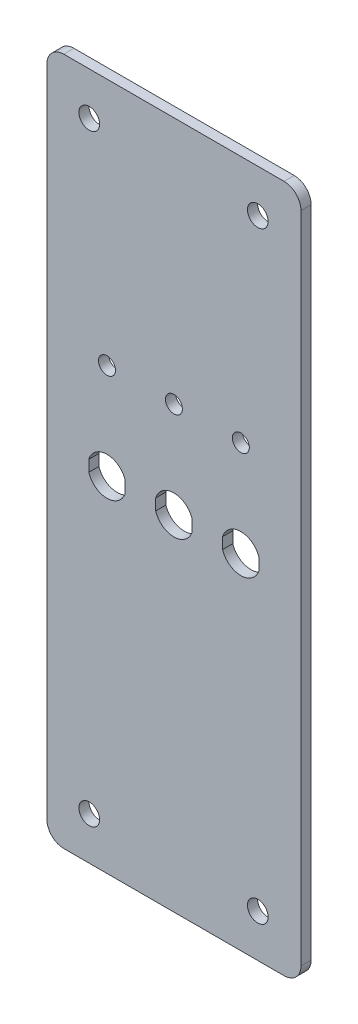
ISO-10303-21;
HEADER;
FILE_DESCRIPTION(('STEP AP214'),'2;1');
FILE_NAME('part.step','',(''),(''),'','','');
FILE_SCHEMA(('AUTOMOTIVE_DESIGN { 1 0 10303 214 1 1 1 1 }'));
ENDSEC;
DATA;
#1=APPLICATION_CONTEXT('core data for automotive mechanical design processes');
#2=APPLICATION_PROTOCOL_DEFINITION('international standard','automotive_design',2000,#1);
#3=PRODUCT_CONTEXT('',#1,'mechanical');
#4=PRODUCT('Part','Part','',(#3));
#5=PRODUCT_RELATED_PRODUCT_CATEGORY('part','',(#4));
#6=PRODUCT_DEFINITION_FORMATION('','',#4);
#7=PRODUCT_DEFINITION_CONTEXT('part definition',#1,'design');
#8=PRODUCT_DEFINITION('design','',#6,#7);
#9=PRODUCT_DEFINITION_SHAPE('','',#8);
#10=(LENGTH_UNIT() NAMED_UNIT(*) SI_UNIT(.MILLI.,.METRE.));
#11=(NAMED_UNIT(*) PLANE_ANGLE_UNIT() SI_UNIT($,.RADIAN.));
#12=(NAMED_UNIT(*) SI_UNIT($,.STERADIAN.) SOLID_ANGLE_UNIT());
#13=UNCERTAINTY_MEASURE_WITH_UNIT(LENGTH_MEASURE(1.E-05),#10,'distance_accuracy_value','');
#14=(GEOMETRIC_REPRESENTATION_CONTEXT(3) GLOBAL_UNCERTAINTY_ASSIGNED_CONTEXT((#13)) GLOBAL_UNIT_ASSIGNED_CONTEXT((#10,
#11,#12)) REPRESENTATION_CONTEXT('',''));
#15=CARTESIAN_POINT('',(0.,0.,0.));
#16=DIRECTION('',(0.,0.,1.));
#17=DIRECTION('',(1.,0.,0.));
#18=AXIS2_PLACEMENT_3D('',#15,#16,#17);
#19=CARTESIAN_POINT('',(38.1,-103.1494,3.048));
#20=DIRECTION('',(-1.,0.,0.));
#21=DIRECTION('',(0.,0.,1.));
#22=AXIS2_PLACEMENT_3D('',#19,#20,#21);
#23=PLANE('',#22);
#24=DIRECTION('',(0.,1.,0.));
#25=VECTOR('',#24,1.);
#26=CARTESIAN_POINT('',(38.1,-103.1494,3.048));
#27=LINE('',#26,#25);
#28=CARTESIAN_POINT('',(38.1,-98.0694,3.048));
#29=VERTEX_POINT('',#28);
#30=CARTESIAN_POINT('',(38.1,98.0693999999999,3.048));
#31=VERTEX_POINT('',#30);
#32=EDGE_CURVE('E307',#29,#31,#27,.T.);
#33=ORIENTED_EDGE('',*,*,#32,.F.);
#34=DIRECTION('',(0.,0.,-1.));
#35=VECTOR('',#34,1.);
#36=CARTESIAN_POINT('',(38.1,-98.0694,3.048));
#37=LINE('',#36,#35);
#38=CARTESIAN_POINT('',(38.1,-98.0694,0.));
#39=VERTEX_POINT('',#38);
#40=EDGE_CURVE('E354',#29,#39,#37,.T.);
#41=ORIENTED_EDGE('',*,*,#40,.T.);
#42=DIRECTION('',(0.,1.,0.));
#43=VECTOR('',#42,1.);
#44=CARTESIAN_POINT('',(38.1,-103.1494,0.));
#45=LINE('',#44,#43);
#46=CARTESIAN_POINT('',(38.1,98.0693999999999,0.));
#47=VERTEX_POINT('',#46);
#48=EDGE_CURVE('E304',#39,#47,#45,.T.);
#49=ORIENTED_EDGE('',*,*,#48,.T.);
#50=DIRECTION('',(0.,0.,-1.));
#51=VECTOR('',#50,1.);
#52=CARTESIAN_POINT('',(38.1,98.0694,3.048));
#53=LINE('',#52,#51);
#54=EDGE_CURVE('E352',#47,#31,#53,.F.);
#55=ORIENTED_EDGE('',*,*,#54,.T.);
#56=EDGE_LOOP('',(#33,#41,#49,#55));
#57=FACE_BOUND('',#56,.T.);
#58=ADVANCED_FACE('F32',(#57),#23,.F.);
#59=CARTESIAN_POINT('',(-38.1,103.1494,3.048));
#60=DIRECTION('',(0.,-1.,0.));
#61=DIRECTION('',(0.,0.,-1.));
#62=AXIS2_PLACEMENT_3D('',#59,#60,#61);
#63=PLANE('',#62);
#64=DIRECTION('',(-1.,0.,0.));
#65=VECTOR('',#64,1.);
#66=CARTESIAN_POINT('',(-38.1,103.1494,3.048));
#67=LINE('',#66,#65);
#68=CARTESIAN_POINT('',(33.02,103.1494,3.048));
#69=VERTEX_POINT('',#68);
#70=CARTESIAN_POINT('',(-33.02,103.1494,3.048));
#71=VERTEX_POINT('',#70);
#72=EDGE_CURVE('E309',#69,#71,#67,.T.);
#73=ORIENTED_EDGE('',*,*,#72,.F.);
#74=DIRECTION('',(0.,0.,-1.));
#75=VECTOR('',#74,1.);
#76=CARTESIAN_POINT('',(33.02,103.1494,3.048));
#77=LINE('',#76,#75);
#78=CARTESIAN_POINT('',(33.02,103.1494,0.));
#79=VERTEX_POINT('',#78);
#80=EDGE_CURVE('E11',#69,#79,#77,.T.);
#81=ORIENTED_EDGE('',*,*,#80,.T.);
#82=DIRECTION('',(-1.,0.,0.));
#83=VECTOR('',#82,1.);
#84=CARTESIAN_POINT('',(-38.1,103.1494,0.));
#85=LINE('',#84,#83);
#86=CARTESIAN_POINT('',(-33.02,103.1494,0.));
#87=VERTEX_POINT('',#86);
#88=EDGE_CURVE('E321',#79,#87,#85,.T.);
#89=ORIENTED_EDGE('',*,*,#88,.T.);
#90=DIRECTION('',(0.,0.,-1.));
#91=VECTOR('',#90,1.);
#92=CARTESIAN_POINT('',(-33.02,103.1494,3.048));
#93=LINE('',#92,#91);
#94=EDGE_CURVE('E41',#87,#71,#93,.F.);
#95=ORIENTED_EDGE('',*,*,#94,.T.);
#96=EDGE_LOOP('',(#73,#81,#89,#95));
#97=FACE_BOUND('',#96,.T.);
#98=ADVANCED_FACE('F440',(#97),#63,.F.);
#99=CARTESIAN_POINT('',(-38.1,-103.1494,3.048));
#100=DIRECTION('',(1.,0.,0.));
#101=DIRECTION('',(0.,0.,-1.));
#102=AXIS2_PLACEMENT_3D('',#99,#100,#101);
#103=PLANE('',#102);
#104=DIRECTION('',(0.,-1.,0.));
#105=VECTOR('',#104,1.);
#106=CARTESIAN_POINT('',(-38.1,-103.1494,0.));
#107=LINE('',#106,#105);
#108=CARTESIAN_POINT('',(-38.1,98.0693999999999,0.));
#109=VERTEX_POINT('',#108);
#110=CARTESIAN_POINT('',(-38.1,-98.0694,0.));
#111=VERTEX_POINT('',#110);
#112=EDGE_CURVE('E323',#109,#111,#107,.T.);
#113=ORIENTED_EDGE('',*,*,#112,.T.);
#114=DIRECTION('',(0.,0.,-1.));
#115=VECTOR('',#114,1.);
#116=CARTESIAN_POINT('',(-38.1,-98.0694,3.048));
#117=LINE('',#116,#115);
#118=CARTESIAN_POINT('',(-38.1,-98.0694,3.048));
#119=VERTEX_POINT('',#118);
#120=EDGE_CURVE('E343',#111,#119,#117,.F.);
#121=ORIENTED_EDGE('',*,*,#120,.T.);
#122=DIRECTION('',(0.,-1.,0.));
#123=VECTOR('',#122,1.);
#124=CARTESIAN_POINT('',(-38.1,-103.1494,3.048));
#125=LINE('',#124,#123);
#126=CARTESIAN_POINT('',(-38.1,98.0693999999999,3.048));
#127=VERTEX_POINT('',#126);
#128=EDGE_CURVE('E312',#127,#119,#125,.T.);
#129=ORIENTED_EDGE('',*,*,#128,.F.);
#130=DIRECTION('',(0.,0.,-1.));
#131=VECTOR('',#130,1.);
#132=CARTESIAN_POINT('',(-38.1,98.0694,3.048));
#133=LINE('',#132,#131);
#134=EDGE_CURVE('E340',#127,#109,#133,.T.);
#135=ORIENTED_EDGE('',*,*,#134,.T.);
#136=EDGE_LOOP('',(#113,#121,#129,#135));
#137=FACE_BOUND('',#136,.T.);
#138=ADVANCED_FACE('F442',(#137),#103,.F.);
#139=CARTESIAN_POINT('',(-38.1,-103.1494,3.048));
#140=DIRECTION('',(0.,1.,0.));
#141=DIRECTION('',(0.,0.,1.));
#142=AXIS2_PLACEMENT_3D('',#139,#140,#141);
#143=PLANE('',#142);
#144=DIRECTION('',(1.,0.,0.));
#145=VECTOR('',#144,1.);
#146=CARTESIAN_POINT('',(-38.1,-103.1494,3.048));
#147=LINE('',#146,#145);
#148=CARTESIAN_POINT('',(-33.02,-103.1494,3.048));
#149=VERTEX_POINT('',#148);
#150=CARTESIAN_POINT('',(33.02,-103.1494,3.048));
#151=VERTEX_POINT('',#150);
#152=EDGE_CURVE('E315',#149,#151,#147,.T.);
#153=ORIENTED_EDGE('',*,*,#152,.F.);
#154=DIRECTION('',(0.,0.,-1.));
#155=VECTOR('',#154,1.);
#156=CARTESIAN_POINT('',(-33.02,-103.1494,3.048));
#157=LINE('',#156,#155);
#158=CARTESIAN_POINT('',(-33.02,-103.1494,0.));
#159=VERTEX_POINT('',#158);
#160=EDGE_CURVE('E329',#149,#159,#157,.T.);
#161=ORIENTED_EDGE('',*,*,#160,.T.);
#162=DIRECTION('',(1.,0.,0.));
#163=VECTOR('',#162,1.);
#164=CARTESIAN_POINT('',(-38.1,-103.1494,0.));
#165=LINE('',#164,#163);
#166=CARTESIAN_POINT('',(33.02,-103.1494,0.));
#167=VERTEX_POINT('',#166);
#168=EDGE_CURVE('E310',#159,#167,#165,.T.);
#169=ORIENTED_EDGE('',*,*,#168,.T.);
#170=DIRECTION('',(0.,0.,-1.));
#171=VECTOR('',#170,1.);
#172=CARTESIAN_POINT('',(33.02,-103.1494,3.048));
#173=LINE('',#172,#171);
#174=EDGE_CURVE('E318',#167,#151,#173,.F.);
#175=ORIENTED_EDGE('',*,*,#174,.T.);
#176=EDGE_LOOP('',(#153,#161,#169,#175));
#177=FACE_BOUND('',#176,.T.);
#178=ADVANCED_FACE('F397',(#177),#143,.F.);
#179=CARTESIAN_POINT('',(0.,0.,3.048));
#180=DIRECTION('',(0.,0.,-1.));
#181=DIRECTION('',(-1.,0.,0.));
#182=AXIS2_PLACEMENT_3D('',#179,#180,#181);
#183=PLANE('',#182);
#184=CARTESIAN_POINT('',(20.066,28.7782,3.048));
#185=DIRECTION('',(0.,0.,1.));
#186=DIRECTION('',(-1.,0.,0.));
#187=AXIS2_PLACEMENT_3D('',#184,#185,#186);
#188=CIRCLE('',#187,2.54);
#189=CARTESIAN_POINT('',(17.526,28.7782,3.048));
#190=VERTEX_POINT('',#189);
#191=EDGE_CURVE('E715',#190,#190,#188,.T.);
#192=ORIENTED_EDGE('',*,*,#191,.F.);
#193=EDGE_LOOP('',(#192));
#194=FACE_BOUND('',#193,.T.);
#195=CARTESIAN_POINT('',(-20.066,28.7782,3.048));
#196=DIRECTION('',(0.,0.,1.));
#197=DIRECTION('',(-1.,0.,0.));
#198=AXIS2_PLACEMENT_3D('',#195,#196,#197);
#199=CIRCLE('',#198,2.54);
#200=CARTESIAN_POINT('',(-22.606,28.7782,3.048));
#201=VERTEX_POINT('',#200);
#202=EDGE_CURVE('E713',#201,#201,#199,.T.);
#203=ORIENTED_EDGE('',*,*,#202,.F.);
#204=EDGE_LOOP('',(#203));
#205=FACE_BOUND('',#204,.T.);
#206=CARTESIAN_POINT('',(0.,28.7782,3.048));
#207=DIRECTION('',(0.,0.,1.));
#208=DIRECTION('',(1.,0.,0.));
#209=AXIS2_PLACEMENT_3D('',#206,#207,#208);
#210=CIRCLE('',#209,2.54);
#211=CARTESIAN_POINT('',(2.54,28.7782,3.048));
#212=VERTEX_POINT('',#211);
#213=EDGE_CURVE('E203',#212,#212,#210,.T.);
#214=ORIENTED_EDGE('',*,*,#213,.F.);
#215=EDGE_LOOP('',(#214));
#216=FACE_BOUND('',#215,.T.);
#217=DIRECTION('',(0.,1.,0.));
#218=VECTOR('',#217,1.);
#219=CARTESIAN_POINT('',(-14.605,1.68484539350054,3.048));
#220=LINE('',#219,#218);
#221=CARTESIAN_POINT('',(-14.605,-1.68484539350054,3.048));
#222=VERTEX_POINT('',#221);
#223=CARTESIAN_POINT('',(-14.605,1.68484539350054,3.048));
#224=VERTEX_POINT('',#223);
#225=EDGE_CURVE('E236',#222,#224,#220,.T.);
#226=ORIENTED_EDGE('',*,*,#225,.F.);
#227=CARTESIAN_POINT('',(-20.066,0.,3.048));
#228=DIRECTION('',(0.,0.,1.));
#229=DIRECTION('',(-1.,0.,0.));
#230=AXIS2_PLACEMENT_3D('',#227,#228,#229);
#231=CIRCLE('',#230,5.715);
#232=CARTESIAN_POINT('',(-25.527,-1.68484539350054,3.048));
#233=VERTEX_POINT('',#232);
#234=EDGE_CURVE('E234',#233,#222,#231,.T.);
#235=ORIENTED_EDGE('',*,*,#234,.F.);
#236=DIRECTION('',(0.,-1.,0.));
#237=VECTOR('',#236,1.);
#238=CARTESIAN_POINT('',(-25.527,-1.68484539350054,3.048));
#239=LINE('',#238,#237);
#240=CARTESIAN_POINT('',(-25.527,1.68484539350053,3.048));
#241=VERTEX_POINT('',#240);
#242=EDGE_CURVE('E224',#241,#233,#239,.T.);
#243=ORIENTED_EDGE('',*,*,#242,.F.);
#244=CARTESIAN_POINT('',(-20.066,0.,3.048));
#245=DIRECTION('',(0.,0.,1.));
#246=DIRECTION('',(-1.,0.,0.));
#247=AXIS2_PLACEMENT_3D('',#244,#245,#246);
#248=CIRCLE('',#247,5.715);
#249=EDGE_CURVE('E239',#224,#241,#248,.T.);
#250=ORIENTED_EDGE('',*,*,#249,.F.);
#251=EDGE_LOOP('',(#226,#235,#243,#250));
#252=FACE_BOUND('',#251,.T.);
#253=DIRECTION('',(0.,1.,0.));
#254=VECTOR('',#253,1.);
#255=CARTESIAN_POINT('',(25.527,1.68484539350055,3.048));
#256=LINE('',#255,#254);
#257=CARTESIAN_POINT('',(25.527,-1.68484539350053,3.048));
#258=VERTEX_POINT('',#257);
#259=CARTESIAN_POINT('',(25.527,1.68484539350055,3.048));
#260=VERTEX_POINT('',#259);
#261=EDGE_CURVE('E209',#258,#260,#256,.T.);
#262=ORIENTED_EDGE('',*,*,#261,.F.);
#263=CARTESIAN_POINT('',(20.066,0.,3.048));
#264=DIRECTION('',(0.,0.,1.));
#265=DIRECTION('',(-1.,0.,0.));
#266=AXIS2_PLACEMENT_3D('',#263,#264,#265);
#267=CIRCLE('',#266,5.715);
#268=CARTESIAN_POINT('',(14.605,-1.68484539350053,3.048));
#269=VERTEX_POINT('',#268);
#270=EDGE_CURVE('E179',#269,#258,#267,.T.);
#271=ORIENTED_EDGE('',*,*,#270,.F.);
#272=DIRECTION('',(0.,-1.,0.));
#273=VECTOR('',#272,1.);
#274=CARTESIAN_POINT('',(14.605,-1.68484539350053,3.048));
#275=LINE('',#274,#273);
#276=CARTESIAN_POINT('',(14.605,1.68484539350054,3.048));
#277=VERTEX_POINT('',#276);
#278=EDGE_CURVE('E197',#277,#269,#275,.T.);
#279=ORIENTED_EDGE('',*,*,#278,.F.);
#280=CARTESIAN_POINT('',(20.066,0.,3.048));
#281=DIRECTION('',(0.,0.,1.));
#282=DIRECTION('',(-1.,0.,0.));
#283=AXIS2_PLACEMENT_3D('',#280,#281,#282);
#284=CIRCLE('',#283,5.715);
#285=EDGE_CURVE('E200',#260,#277,#284,.T.);
#286=ORIENTED_EDGE('',*,*,#285,.F.);
#287=EDGE_LOOP('',(#262,#271,#279,#286));
#288=FACE_BOUND('',#287,.T.);
#289=DIRECTION('',(0.,-1.,0.));
#290=VECTOR('',#289,1.);
#291=CARTESIAN_POINT('',(-5.461,1.68484539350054,3.048));
#292=LINE('',#291,#290);
#293=CARTESIAN_POINT('',(-5.461,1.68484539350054,3.048));
#294=VERTEX_POINT('',#293);
#295=CARTESIAN_POINT('',(-5.461,-1.68484539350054,3.048));
#296=VERTEX_POINT('',#295);
#297=EDGE_CURVE('E266',#294,#296,#292,.T.);
#298=ORIENTED_EDGE('',*,*,#297,.F.);
#299=CARTESIAN_POINT('',(0.,0.,3.048));
#300=DIRECTION('',(0.,0.,1.));
#301=DIRECTION('',(1.,0.,0.));
#302=AXIS2_PLACEMENT_3D('',#299,#300,#301);
#303=CIRCLE('',#302,5.715);
#304=CARTESIAN_POINT('',(5.461,1.68484539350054,3.048));
#305=VERTEX_POINT('',#304);
#306=EDGE_CURVE('E216',#305,#294,#303,.T.);
#307=ORIENTED_EDGE('',*,*,#306,.F.);
#308=DIRECTION('',(0.,1.,0.));
#309=VECTOR('',#308,1.);
#310=CARTESIAN_POINT('',(5.461,-1.68484539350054,3.048));
#311=LINE('',#310,#309);
#312=CARTESIAN_POINT('',(5.461,-1.68484539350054,3.048));
#313=VERTEX_POINT('',#312);
#314=EDGE_CURVE('E255',#313,#305,#311,.T.);
#315=ORIENTED_EDGE('',*,*,#314,.F.);
#316=CARTESIAN_POINT('',(0.,0.,3.048));
#317=DIRECTION('',(0.,0.,1.));
#318=DIRECTION('',(1.,0.,0.));
#319=AXIS2_PLACEMENT_3D('',#316,#317,#318);
#320=CIRCLE('',#319,5.715);
#321=EDGE_CURVE('E269',#296,#313,#320,.T.);
#322=ORIENTED_EDGE('',*,*,#321,.F.);
#323=EDGE_LOOP('',(#298,#307,#315,#322));
#324=FACE_BOUND('',#323,.T.);
#325=CARTESIAN_POINT('',(25.146,90.3097,3.048));
#326=DIRECTION('',(0.,0.,1.));
#327=DIRECTION('',(1.,0.,0.));
#328=AXIS2_PLACEMENT_3D('',#325,#326,#327);
#329=CIRCLE('',#328,3.0988);
#330=CARTESIAN_POINT('',(28.2448,90.3097,3.048));
#331=VERTEX_POINT('',#330);
#332=EDGE_CURVE('E293',#331,#331,#329,.T.);
#333=ORIENTED_EDGE('',*,*,#332,.F.);
#334=EDGE_LOOP('',(#333));
#335=FACE_BOUND('',#334,.T.);
#336=CARTESIAN_POINT('',(25.146,-90.3097,3.048));
#337=DIRECTION('',(0.,0.,1.));
#338=DIRECTION('',(1.,0.,0.));
#339=AXIS2_PLACEMENT_3D('',#336,#337,#338);
#340=CIRCLE('',#339,3.09879999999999);
#341=CARTESIAN_POINT('',(28.2448,-90.3097,3.048));
#342=VERTEX_POINT('',#341);
#343=EDGE_CURVE('E286',#342,#342,#340,.T.);
#344=ORIENTED_EDGE('',*,*,#343,.F.);
#345=EDGE_LOOP('',(#344));
#346=FACE_BOUND('',#345,.T.);
#347=CARTESIAN_POINT('',(-25.4,-90.3097,3.048));
#348=DIRECTION('',(0.,0.,1.));
#349=DIRECTION('',(1.,0.,0.));
#350=AXIS2_PLACEMENT_3D('',#347,#348,#349);
#351=CIRCLE('',#350,3.0988);
#352=CARTESIAN_POINT('',(-22.3012,-90.3097,3.048));
#353=VERTEX_POINT('',#352);
#354=EDGE_CURVE('E276',#353,#353,#351,.T.);
#355=ORIENTED_EDGE('',*,*,#354,.F.);
#356=EDGE_LOOP('',(#355));
#357=FACE_BOUND('',#356,.T.);
#358=CARTESIAN_POINT('',(-25.4,90.3097,3.048));
#359=DIRECTION('',(0.,0.,1.));
#360=DIRECTION('',(1.,0.,0.));
#361=AXIS2_PLACEMENT_3D('',#358,#359,#360);
#362=CIRCLE('',#361,3.0988);
#363=CARTESIAN_POINT('',(-22.3012,90.3097,3.048));
#364=VERTEX_POINT('',#363);
#365=EDGE_CURVE('E292',#364,#364,#362,.T.);
#366=ORIENTED_EDGE('',*,*,#365,.F.);
#367=EDGE_LOOP('',(#366));
#368=FACE_BOUND('',#367,.T.);
#369=ORIENTED_EDGE('',*,*,#128,.T.);
#370=CARTESIAN_POINT('',(-33.02,-98.0694,3.048));
#371=DIRECTION('',(0.,0.,-1.));
#372=DIRECTION('',(-1.,0.,0.));
#373=AXIS2_PLACEMENT_3D('',#370,#371,#372);
#374=CIRCLE('',#373,5.08);
#375=EDGE_CURVE('E350',#119,#149,#374,.F.);
#376=ORIENTED_EDGE('',*,*,#375,.T.);
#377=ORIENTED_EDGE('',*,*,#152,.T.);
#378=CARTESIAN_POINT('',(33.02,-98.0694,3.048));
#379=DIRECTION('',(0.,0.,-1.));
#380=DIRECTION('',(-1.,0.,0.));
#381=AXIS2_PLACEMENT_3D('',#378,#379,#380);
#382=CIRCLE('',#381,5.08);
#383=EDGE_CURVE('E348',#151,#29,#382,.F.);
#384=ORIENTED_EDGE('',*,*,#383,.T.);
#385=ORIENTED_EDGE('',*,*,#32,.T.);
#386=CARTESIAN_POINT('',(33.02,98.0694,3.048));
#387=DIRECTION('',(0.,0.,-1.));
#388=DIRECTION('',(-1.,0.,0.));
#389=AXIS2_PLACEMENT_3D('',#386,#387,#388);
#390=CIRCLE('',#389,5.08);
#391=EDGE_CURVE('E55',#31,#69,#390,.F.);
#392=ORIENTED_EDGE('',*,*,#391,.T.);
#393=ORIENTED_EDGE('',*,*,#72,.T.);
#394=CARTESIAN_POINT('',(-33.02,98.0694,3.048));
#395=DIRECTION('',(0.,0.,-1.));
#396=DIRECTION('',(-1.,0.,0.));
#397=AXIS2_PLACEMENT_3D('',#394,#395,#396);
#398=CIRCLE('',#397,5.08);
#399=EDGE_CURVE('E345',#71,#127,#398,.F.);
#400=ORIENTED_EDGE('',*,*,#399,.T.);
#401=EDGE_LOOP('',(#369,#376,#377,#384,#385,#392,#393,#400));
#402=FACE_BOUND('',#401,.T.);
#403=ADVANCED_FACE('F373',(#194,#205,#216,#252,#288,#324,#335,#346,#357,#368,#402),#183,.F.);
#404=CARTESIAN_POINT('',(0.,0.,0.));
#405=DIRECTION('',(0.,0.,-1.));
#406=DIRECTION('',(-1.,0.,0.));
#407=AXIS2_PLACEMENT_3D('',#404,#405,#406);
#408=PLANE('',#407);
#409=CARTESIAN_POINT('',(20.066,28.7782,0.));
#410=DIRECTION('',(0.,0.,-1.));
#411=DIRECTION('',(-1.,0.,0.));
#412=AXIS2_PLACEMENT_3D('',#409,#410,#411);
#413=CIRCLE('',#412,2.54);
#414=CARTESIAN_POINT('',(17.526,28.7782,0.));
#415=VERTEX_POINT('',#414);
#416=EDGE_CURVE('E36',#415,#415,#413,.T.);
#417=ORIENTED_EDGE('',*,*,#416,.F.);
#418=EDGE_LOOP('',(#417));
#419=FACE_BOUND('',#418,.T.);
#420=CARTESIAN_POINT('',(-20.066,28.7782,0.));
#421=DIRECTION('',(0.,0.,-1.));
#422=DIRECTION('',(-1.,0.,0.));
#423=AXIS2_PLACEMENT_3D('',#420,#421,#422);
#424=CIRCLE('',#423,2.54);
#425=CARTESIAN_POINT('',(-22.606,28.7782,0.));
#426=VERTEX_POINT('',#425);
#427=EDGE_CURVE('E360',#426,#426,#424,.T.);
#428=ORIENTED_EDGE('',*,*,#427,.F.);
#429=EDGE_LOOP('',(#428));
#430=FACE_BOUND('',#429,.T.);
#431=CARTESIAN_POINT('',(0.,28.7782,0.));
#432=DIRECTION('',(0.,0.,-1.));
#433=DIRECTION('',(-1.,0.,0.));
#434=AXIS2_PLACEMENT_3D('',#431,#432,#433);
#435=CIRCLE('',#434,2.54);
#436=CARTESIAN_POINT('',(-2.54,28.7782,0.));
#437=VERTEX_POINT('',#436);
#438=EDGE_CURVE('E358',#437,#437,#435,.T.);
#439=ORIENTED_EDGE('',*,*,#438,.F.);
#440=EDGE_LOOP('',(#439));
#441=FACE_BOUND('',#440,.T.);
#442=CARTESIAN_POINT('',(-20.066,0.,0.));
#443=DIRECTION('',(0.,0.,1.));
#444=DIRECTION('',(-1.,0.,0.));
#445=AXIS2_PLACEMENT_3D('',#442,#443,#444);
#446=CIRCLE('',#445,5.715);
#447=CARTESIAN_POINT('',(-25.527,-1.68484539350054,0.));
#448=VERTEX_POINT('',#447);
#449=CARTESIAN_POINT('',(-14.605,-1.68484539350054,0.));
#450=VERTEX_POINT('',#449);
#451=EDGE_CURVE('E220',#448,#450,#446,.T.);
#452=ORIENTED_EDGE('',*,*,#451,.T.);
#453=DIRECTION('',(0.,1.,0.));
#454=VECTOR('',#453,1.);
#455=CARTESIAN_POINT('',(-14.605,1.68484539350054,0.));
#456=LINE('',#455,#454);
#457=CARTESIAN_POINT('',(-14.605,1.68484539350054,0.));
#458=VERTEX_POINT('',#457);
#459=EDGE_CURVE('E223',#450,#458,#456,.T.);
#460=ORIENTED_EDGE('',*,*,#459,.T.);
#461=CARTESIAN_POINT('',(-20.066,0.,0.));
#462=DIRECTION('',(0.,0.,1.));
#463=DIRECTION('',(-1.,0.,0.));
#464=AXIS2_PLACEMENT_3D('',#461,#462,#463);
#465=CIRCLE('',#464,5.715);
#466=CARTESIAN_POINT('',(-25.527,1.68484539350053,0.));
#467=VERTEX_POINT('',#466);
#468=EDGE_CURVE('E227',#458,#467,#465,.T.);
#469=ORIENTED_EDGE('',*,*,#468,.T.);
#470=DIRECTION('',(0.,-1.,0.));
#471=VECTOR('',#470,1.);
#472=CARTESIAN_POINT('',(-25.527,-1.68484539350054,0.));
#473=LINE('',#472,#471);
#474=EDGE_CURVE('E230',#467,#448,#473,.T.);
#475=ORIENTED_EDGE('',*,*,#474,.T.);
#476=EDGE_LOOP('',(#452,#460,#469,#475));
#477=FACE_BOUND('',#476,.T.);
#478=CARTESIAN_POINT('',(20.066,0.,0.));
#479=DIRECTION('',(0.,0.,1.));
#480=DIRECTION('',(-1.,0.,0.));
#481=AXIS2_PLACEMENT_3D('',#478,#479,#480);
#482=CIRCLE('',#481,5.715);
#483=CARTESIAN_POINT('',(14.605,-1.68484539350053,0.));
#484=VERTEX_POINT('',#483);
#485=CARTESIAN_POINT('',(25.527,-1.68484539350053,0.));
#486=VERTEX_POINT('',#485);
#487=EDGE_CURVE('E176',#484,#486,#482,.T.);
#488=ORIENTED_EDGE('',*,*,#487,.T.);
#489=DIRECTION('',(0.,1.,0.));
#490=VECTOR('',#489,1.);
#491=CARTESIAN_POINT('',(25.527,1.68484539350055,0.));
#492=LINE('',#491,#490);
#493=CARTESIAN_POINT('',(25.527,1.68484539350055,0.));
#494=VERTEX_POINT('',#493);
#495=EDGE_CURVE('E188',#486,#494,#492,.T.);
#496=ORIENTED_EDGE('',*,*,#495,.T.);
#497=CARTESIAN_POINT('',(20.066,0.,0.));
#498=DIRECTION('',(0.,0.,1.));
#499=DIRECTION('',(-1.,0.,0.));
#500=AXIS2_PLACEMENT_3D('',#497,#498,#499);
#501=CIRCLE('',#500,5.715);
#502=CARTESIAN_POINT('',(14.605,1.68484539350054,0.));
#503=VERTEX_POINT('',#502);
#504=EDGE_CURVE('E192',#494,#503,#501,.T.);
#505=ORIENTED_EDGE('',*,*,#504,.T.);
#506=DIRECTION('',(0.,-1.,0.));
#507=VECTOR('',#506,1.);
#508=CARTESIAN_POINT('',(14.605,-1.68484539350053,0.));
#509=LINE('',#508,#507);
#510=EDGE_CURVE('E184',#503,#484,#509,.T.);
#511=ORIENTED_EDGE('',*,*,#510,.T.);
#512=EDGE_LOOP('',(#488,#496,#505,#511));
#513=FACE_BOUND('',#512,.T.);
#514=CARTESIAN_POINT('',(0.,0.,0.));
#515=DIRECTION('',(0.,0.,1.));
#516=DIRECTION('',(1.,0.,0.));
#517=AXIS2_PLACEMENT_3D('',#514,#515,#516);
#518=CIRCLE('',#517,5.715);
#519=CARTESIAN_POINT('',(5.461,1.68484539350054,0.));
#520=VERTEX_POINT('',#519);
#521=CARTESIAN_POINT('',(-5.461,1.68484539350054,0.));
#522=VERTEX_POINT('',#521);
#523=EDGE_CURVE('E251',#520,#522,#518,.T.);
#524=ORIENTED_EDGE('',*,*,#523,.T.);
#525=DIRECTION('',(0.,-1.,0.));
#526=VECTOR('',#525,1.);
#527=CARTESIAN_POINT('',(-5.461,1.68484539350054,0.));
#528=LINE('',#527,#526);
#529=CARTESIAN_POINT('',(-5.461,-1.68484539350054,0.));
#530=VERTEX_POINT('',#529);
#531=EDGE_CURVE('E254',#522,#530,#528,.T.);
#532=ORIENTED_EDGE('',*,*,#531,.T.);
#533=CARTESIAN_POINT('',(0.,0.,0.));
#534=DIRECTION('',(0.,0.,1.));
#535=DIRECTION('',(1.,0.,0.));
#536=AXIS2_PLACEMENT_3D('',#533,#534,#535);
#537=CIRCLE('',#536,5.715);
#538=CARTESIAN_POINT('',(5.461,-1.68484539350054,0.));
#539=VERTEX_POINT('',#538);
#540=EDGE_CURVE('E258',#530,#539,#537,.T.);
#541=ORIENTED_EDGE('',*,*,#540,.T.);
#542=DIRECTION('',(0.,1.,0.));
#543=VECTOR('',#542,1.);
#544=CARTESIAN_POINT('',(5.461,-1.68484539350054,0.));
#545=LINE('',#544,#543);
#546=EDGE_CURVE('E261',#539,#520,#545,.T.);
#547=ORIENTED_EDGE('',*,*,#546,.T.);
#548=EDGE_LOOP('',(#524,#532,#541,#547));
#549=FACE_BOUND('',#548,.T.);
#550=CARTESIAN_POINT('',(25.146,90.3097,0.));
#551=DIRECTION('',(0.,0.,1.));
#552=DIRECTION('',(1.,0.,0.));
#553=AXIS2_PLACEMENT_3D('',#550,#551,#552);
#554=CIRCLE('',#553,3.0988);
#555=CARTESIAN_POINT('',(28.2448,90.3097,0.));
#556=VERTEX_POINT('',#555);
#557=EDGE_CURVE('E289',#556,#556,#554,.T.);
#558=ORIENTED_EDGE('',*,*,#557,.T.);
#559=EDGE_LOOP('',(#558));
#560=FACE_BOUND('',#559,.T.);
#561=CARTESIAN_POINT('',(25.146,-90.3097,0.));
#562=DIRECTION('',(0.,0.,1.));
#563=DIRECTION('',(1.,0.,0.));
#564=AXIS2_PLACEMENT_3D('',#561,#562,#563);
#565=CIRCLE('',#564,3.09879999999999);
#566=CARTESIAN_POINT('',(28.2448,-90.3097,0.));
#567=VERTEX_POINT('',#566);
#568=EDGE_CURVE('E296',#567,#567,#565,.T.);
#569=ORIENTED_EDGE('',*,*,#568,.T.);
#570=EDGE_LOOP('',(#569));
#571=FACE_BOUND('',#570,.T.);
#572=CARTESIAN_POINT('',(-25.4,-90.3097,0.));
#573=DIRECTION('',(0.,0.,1.));
#574=DIRECTION('',(1.,0.,0.));
#575=AXIS2_PLACEMENT_3D('',#572,#573,#574);
#576=CIRCLE('',#575,3.0988);
#577=CARTESIAN_POINT('',(-22.3012,-90.3097,0.));
#578=VERTEX_POINT('',#577);
#579=EDGE_CURVE('E283',#578,#578,#576,.T.);
#580=ORIENTED_EDGE('',*,*,#579,.T.);
#581=EDGE_LOOP('',(#580));
#582=FACE_BOUND('',#581,.T.);
#583=CARTESIAN_POINT('',(-25.4,90.3097,0.));
#584=DIRECTION('',(0.,0.,1.));
#585=DIRECTION('',(1.,0.,0.));
#586=AXIS2_PLACEMENT_3D('',#583,#584,#585);
#587=CIRCLE('',#586,3.0988);
#588=CARTESIAN_POINT('',(-22.3012,90.3097,0.));
#589=VERTEX_POINT('',#588);
#590=EDGE_CURVE('E301',#589,#589,#587,.T.);
#591=ORIENTED_EDGE('',*,*,#590,.T.);
#592=EDGE_LOOP('',(#591));
#593=FACE_BOUND('',#592,.T.);
#594=ORIENTED_EDGE('',*,*,#168,.F.);
#595=CARTESIAN_POINT('',(-33.02,-98.0694,0.));
#596=DIRECTION('',(0.,0.,-1.));
#597=DIRECTION('',(-1.,0.,0.));
#598=AXIS2_PLACEMENT_3D('',#595,#596,#597);
#599=CIRCLE('',#598,5.08);
#600=EDGE_CURVE('E338',#159,#111,#599,.T.);
#601=ORIENTED_EDGE('',*,*,#600,.T.);
#602=ORIENTED_EDGE('',*,*,#112,.F.);
#603=CARTESIAN_POINT('',(-33.02,98.0694,0.));
#604=DIRECTION('',(0.,0.,-1.));
#605=DIRECTION('',(-1.,0.,0.));
#606=AXIS2_PLACEMENT_3D('',#603,#604,#605);
#607=CIRCLE('',#606,5.08);
#608=EDGE_CURVE('E332',#109,#87,#607,.T.);
#609=ORIENTED_EDGE('',*,*,#608,.T.);
#610=ORIENTED_EDGE('',*,*,#88,.F.);
#611=CARTESIAN_POINT('',(33.02,98.0694,0.));
#612=DIRECTION('',(0.,0.,-1.));
#613=DIRECTION('',(-1.,0.,0.));
#614=AXIS2_PLACEMENT_3D('',#611,#612,#613);
#615=CIRCLE('',#614,5.08);
#616=EDGE_CURVE('E334',#79,#47,#615,.T.);
#617=ORIENTED_EDGE('',*,*,#616,.T.);
#618=ORIENTED_EDGE('',*,*,#48,.F.);
#619=CARTESIAN_POINT('',(33.02,-98.0694,0.));
#620=DIRECTION('',(0.,0.,-1.));
#621=DIRECTION('',(-1.,0.,0.));
#622=AXIS2_PLACEMENT_3D('',#619,#620,#621);
#623=CIRCLE('',#622,5.08);
#624=EDGE_CURVE('E336',#39,#167,#623,.T.);
#625=ORIENTED_EDGE('',*,*,#624,.T.);
#626=EDGE_LOOP('',(#594,#601,#602,#609,#610,#617,#618,#625));
#627=FACE_BOUND('',#626,.T.);
#628=ADVANCED_FACE('F194',(#419,#430,#441,#477,#513,#549,#560,#571,#582,#593,#627),#408,.T.);
#629=CARTESIAN_POINT('',(-25.4,90.3097,0.));
#630=DIRECTION('',(0.,0.,1.));
#631=DIRECTION('',(1.,0.,0.));
#632=AXIS2_PLACEMENT_3D('',#629,#630,#631);
#633=CYLINDRICAL_SURFACE('',#632,3.0988);
#634=CARTESIAN_POINT('',(-22.3012,90.3097,0.));
#635=CARTESIAN_POINT('',(-22.3012,90.3097,0.03175));
#636=CARTESIAN_POINT('',(-22.3012,90.3097,0.0635));
#637=CARTESIAN_POINT('',(-22.3012,90.3097,0.127));
#638=CARTESIAN_POINT('',(-22.3012,90.3097,0.15875));
#639=CARTESIAN_POINT('',(-22.3012,90.3097,0.22225));
#640=CARTESIAN_POINT('',(-22.3012,90.3097,0.254));
#641=CARTESIAN_POINT('',(-22.3012,90.3097,0.3175));
#642=CARTESIAN_POINT('',(-22.3012,90.3097,0.34925));
#643=CARTESIAN_POINT('',(-22.3012,90.3097,0.41275));
#644=CARTESIAN_POINT('',(-22.3012,90.3097,0.4445));
#645=CARTESIAN_POINT('',(-22.3012,90.3097,0.508));
#646=CARTESIAN_POINT('',(-22.3012,90.3097,0.53975));
#647=CARTESIAN_POINT('',(-22.3012,90.3097,0.60325));
#648=CARTESIAN_POINT('',(-22.3012,90.3097,0.635));
#649=CARTESIAN_POINT('',(-22.3012,90.3097,0.6985));
#650=CARTESIAN_POINT('',(-22.3012,90.3097,0.73025));
#651=CARTESIAN_POINT('',(-22.3012,90.3097,0.79375));
#652=CARTESIAN_POINT('',(-22.3012,90.3097,0.8255));
#653=CARTESIAN_POINT('',(-22.3012,90.3097,0.889));
#654=CARTESIAN_POINT('',(-22.3012,90.3097,0.92075));
#655=CARTESIAN_POINT('',(-22.3012,90.3097,0.98425));
#656=CARTESIAN_POINT('',(-22.3012,90.3097,1.016));
#657=CARTESIAN_POINT('',(-22.3012,90.3097,1.0795));
#658=CARTESIAN_POINT('',(-22.3012,90.3097,1.11125));
#659=CARTESIAN_POINT('',(-22.3012,90.3097,1.17475));
#660=CARTESIAN_POINT('',(-22.3012,90.3097,1.2065));
#661=CARTESIAN_POINT('',(-22.3012,90.3097,1.27));
#662=CARTESIAN_POINT('',(-22.3012,90.3097,1.30175));
#663=CARTESIAN_POINT('',(-22.3012,90.3097,1.36525));
#664=CARTESIAN_POINT('',(-22.3012,90.3097,1.397));
#665=CARTESIAN_POINT('',(-22.3012,90.3097,1.4605));
#666=CARTESIAN_POINT('',(-22.3012,90.3097,1.49225));
#667=CARTESIAN_POINT('',(-22.3012,90.3097,1.55575));
#668=CARTESIAN_POINT('',(-22.3012,90.3097,1.5875));
#669=CARTESIAN_POINT('',(-22.3012,90.3097,1.651));
#670=CARTESIAN_POINT('',(-22.3012,90.3097,1.68275));
#671=CARTESIAN_POINT('',(-22.3012,90.3097,1.74625));
#672=CARTESIAN_POINT('',(-22.3012,90.3097,1.778));
#673=CARTESIAN_POINT('',(-22.3012,90.3097,1.8415));
#674=CARTESIAN_POINT('',(-22.3012,90.3097,1.87325));
#675=CARTESIAN_POINT('',(-22.3012,90.3097,1.93675));
#676=CARTESIAN_POINT('',(-22.3012,90.3097,1.9685));
#677=CARTESIAN_POINT('',(-22.3012,90.3097,2.032));
#678=CARTESIAN_POINT('',(-22.3012,90.3097,2.06375));
#679=CARTESIAN_POINT('',(-22.3012,90.3097,2.12725));
#680=CARTESIAN_POINT('',(-22.3012,90.3097,2.159));
#681=CARTESIAN_POINT('',(-22.3012,90.3097,2.2225));
#682=CARTESIAN_POINT('',(-22.3012,90.3097,2.25425));
#683=CARTESIAN_POINT('',(-22.3012,90.3097,2.31775));
#684=CARTESIAN_POINT('',(-22.3012,90.3097,2.3495));
#685=CARTESIAN_POINT('',(-22.3012,90.3097,2.413));
#686=CARTESIAN_POINT('',(-22.3012,90.3097,2.44475));
#687=CARTESIAN_POINT('',(-22.3012,90.3097,2.50825));
#688=CARTESIAN_POINT('',(-22.3012,90.3097,2.54));
#689=CARTESIAN_POINT('',(-22.3012,90.3097,2.6035));
#690=CARTESIAN_POINT('',(-22.3012,90.3097,2.63525));
#691=CARTESIAN_POINT('',(-22.3012,90.3097,2.69875));
#692=CARTESIAN_POINT('',(-22.3012,90.3097,2.7305));
#693=CARTESIAN_POINT('',(-22.3012,90.3097,2.794));
#694=CARTESIAN_POINT('',(-22.3012,90.3097,2.82575));
#695=CARTESIAN_POINT('',(-22.3012,90.3097,2.88925));
#696=CARTESIAN_POINT('',(-22.3012,90.3097,2.921));
#697=CARTESIAN_POINT('',(-22.3012,90.3097,2.9845));
#698=CARTESIAN_POINT('',(-22.3012,90.3097,3.01625));
#699=CARTESIAN_POINT('',(-22.3012,90.3097,3.048));
#700=B_SPLINE_CURVE_WITH_KNOTS('',3,(#634,#635,#636,#637,#638,#639,#640,#641,#642,#643,#644,
#645,#646,#647,#648,#649,#650,#651,#652,#653,#654,#655,#656,#657,#658,#659,#660,#661,#662,#663,
#664,#665,#666,#667,#668,#669,#670,#671,#672,#673,#674,#675,#676,#677,#678,#679,#680,#681,#682,
#683,#684,#685,#686,#687,#688,#689,#690,#691,#692,#693,#694,#695,#696,#697,#698,#699),
.UNSPECIFIED.,.F.,.F.,(4,2,2,2,2,2,2,2,2,2,2,2,2,2,2,2,2,2,2,2,2,2,2,2,2,2,2,2,2,2,2,2,4),(0.,
0.09525,0.1905,0.28575,0.381,0.47625,0.5715,0.66675,0.762,0.85725,0.9525,1.04775,1.143,1.23825,
1.3335,1.42875,1.524,1.61925,1.7145,1.80975,1.905,2.00025,2.0955,2.19075,2.286,2.38125,2.4765,
2.57175,2.667,2.76225,2.8575,2.95275,3.048),.UNSPECIFIED.);
#701=EDGE_CURVE('BSEAM372',#589,#364,#700,.T.);
#702=ORIENTED_EDGE('',*,*,#590,.F.);
#703=ORIENTED_EDGE('',*,*,#365,.T.);
#704=ORIENTED_EDGE('',*,*,#701,.T.);
#705=ORIENTED_EDGE('',*,*,#701,.F.);
#706=EDGE_LOOP('',(#702,#704,#703,#705));
#707=FACE_BOUND('',#706,.T.);
#708=ADVANCED_FACE('F372',(#707),#633,.F.);
#709=CARTESIAN_POINT('',(-25.4,-90.3097,0.));
#710=DIRECTION('',(0.,0.,1.));
#711=DIRECTION('',(1.,0.,0.));
#712=AXIS2_PLACEMENT_3D('',#709,#710,#711);
#713=CYLINDRICAL_SURFACE('',#712,3.0988);
#714=CARTESIAN_POINT('',(-22.3012,-90.3097,0.));
#715=CARTESIAN_POINT('',(-22.3012,-90.3097,0.03175));
#716=CARTESIAN_POINT('',(-22.3012,-90.3097,0.0635));
#717=CARTESIAN_POINT('',(-22.3012,-90.3097,0.127));
#718=CARTESIAN_POINT('',(-22.3012,-90.3097,0.15875));
#719=CARTESIAN_POINT('',(-22.3012,-90.3097,0.22225));
#720=CARTESIAN_POINT('',(-22.3012,-90.3097,0.254));
#721=CARTESIAN_POINT('',(-22.3012,-90.3097,0.3175));
#722=CARTESIAN_POINT('',(-22.3012,-90.3097,0.34925));
#723=CARTESIAN_POINT('',(-22.3012,-90.3097,0.41275));
#724=CARTESIAN_POINT('',(-22.3012,-90.3097,0.4445));
#725=CARTESIAN_POINT('',(-22.3012,-90.3097,0.508));
#726=CARTESIAN_POINT('',(-22.3012,-90.3097,0.53975));
#727=CARTESIAN_POINT('',(-22.3012,-90.3097,0.60325));
#728=CARTESIAN_POINT('',(-22.3012,-90.3097,0.635));
#729=CARTESIAN_POINT('',(-22.3012,-90.3097,0.6985));
#730=CARTESIAN_POINT('',(-22.3012,-90.3097,0.73025));
#731=CARTESIAN_POINT('',(-22.3012,-90.3097,0.79375));
#732=CARTESIAN_POINT('',(-22.3012,-90.3097,0.8255));
#733=CARTESIAN_POINT('',(-22.3012,-90.3097,0.889));
#734=CARTESIAN_POINT('',(-22.3012,-90.3097,0.92075));
#735=CARTESIAN_POINT('',(-22.3012,-90.3097,0.98425));
#736=CARTESIAN_POINT('',(-22.3012,-90.3097,1.016));
#737=CARTESIAN_POINT('',(-22.3012,-90.3097,1.0795));
#738=CARTESIAN_POINT('',(-22.3012,-90.3097,1.11125));
#739=CARTESIAN_POINT('',(-22.3012,-90.3097,1.17475));
#740=CARTESIAN_POINT('',(-22.3012,-90.3097,1.2065));
#741=CARTESIAN_POINT('',(-22.3012,-90.3097,1.27));
#742=CARTESIAN_POINT('',(-22.3012,-90.3097,1.30175));
#743=CARTESIAN_POINT('',(-22.3012,-90.3097,1.36525));
#744=CARTESIAN_POINT('',(-22.3012,-90.3097,1.397));
#745=CARTESIAN_POINT('',(-22.3012,-90.3097,1.4605));
#746=CARTESIAN_POINT('',(-22.3012,-90.3097,1.49225));
#747=CARTESIAN_POINT('',(-22.3012,-90.3097,1.55575));
#748=CARTESIAN_POINT('',(-22.3012,-90.3097,1.5875));
#749=CARTESIAN_POINT('',(-22.3012,-90.3097,1.651));
#750=CARTESIAN_POINT('',(-22.3012,-90.3097,1.68275));
#751=CARTESIAN_POINT('',(-22.3012,-90.3097,1.74625));
#752=CARTESIAN_POINT('',(-22.3012,-90.3097,1.778));
#753=CARTESIAN_POINT('',(-22.3012,-90.3097,1.8415));
#754=CARTESIAN_POINT('',(-22.3012,-90.3097,1.87325));
#755=CARTESIAN_POINT('',(-22.3012,-90.3097,1.93675));
#756=CARTESIAN_POINT('',(-22.3012,-90.3097,1.9685));
#757=CARTESIAN_POINT('',(-22.3012,-90.3097,2.032));
#758=CARTESIAN_POINT('',(-22.3012,-90.3097,2.06375));
#759=CARTESIAN_POINT('',(-22.3012,-90.3097,2.12725));
#760=CARTESIAN_POINT('',(-22.3012,-90.3097,2.159));
#761=CARTESIAN_POINT('',(-22.3012,-90.3097,2.2225));
#762=CARTESIAN_POINT('',(-22.3012,-90.3097,2.25425));
#763=CARTESIAN_POINT('',(-22.3012,-90.3097,2.31775));
#764=CARTESIAN_POINT('',(-22.3012,-90.3097,2.3495));
#765=CARTESIAN_POINT('',(-22.3012,-90.3097,2.413));
#766=CARTESIAN_POINT('',(-22.3012,-90.3097,2.44475));
#767=CARTESIAN_POINT('',(-22.3012,-90.3097,2.50825));
#768=CARTESIAN_POINT('',(-22.3012,-90.3097,2.54));
#769=CARTESIAN_POINT('',(-22.3012,-90.3097,2.6035));
#770=CARTESIAN_POINT('',(-22.3012,-90.3097,2.63525));
#771=CARTESIAN_POINT('',(-22.3012,-90.3097,2.69875));
#772=CARTESIAN_POINT('',(-22.3012,-90.3097,2.7305));
#773=CARTESIAN_POINT('',(-22.3012,-90.3097,2.794));
#774=CARTESIAN_POINT('',(-22.3012,-90.3097,2.82575));
#775=CARTESIAN_POINT('',(-22.3012,-90.3097,2.88925));
#776=CARTESIAN_POINT('',(-22.3012,-90.3097,2.921));
#777=CARTESIAN_POINT('',(-22.3012,-90.3097,2.9845));
#778=CARTESIAN_POINT('',(-22.3012,-90.3097,3.01625));
#779=CARTESIAN_POINT('',(-22.3012,-90.3097,3.048));
#780=B_SPLINE_CURVE_WITH_KNOTS('',3,(#714,#715,#716,#717,#718,#719,#720,#721,#722,#723,#724,
#725,#726,#727,#728,#729,#730,#731,#732,#733,#734,#735,#736,#737,#738,#739,#740,#741,#742,#743,
#744,#745,#746,#747,#748,#749,#750,#751,#752,#753,#754,#755,#756,#757,#758,#759,#760,#761,#762,
#763,#764,#765,#766,#767,#768,#769,#770,#771,#772,#773,#774,#775,#776,#777,#778,#779),
.UNSPECIFIED.,.F.,.F.,(4,2,2,2,2,2,2,2,2,2,2,2,2,2,2,2,2,2,2,2,2,2,2,2,2,2,2,2,2,2,2,2,4),(0.,
0.09525,0.1905,0.28575,0.381,0.47625,0.5715,0.66675,0.762,0.85725,0.9525,1.04775,1.143,1.23825,
1.3335,1.42875,1.524,1.61925,1.7145,1.80975,1.905,2.00025,2.0955,2.19075,2.286,2.38125,2.4765,
2.57175,2.667,2.76225,2.8575,2.95275,3.048),.UNSPECIFIED.);
#781=EDGE_CURVE('BSEAM514',#578,#353,#780,.T.);
#782=ORIENTED_EDGE('',*,*,#579,.F.);
#783=ORIENTED_EDGE('',*,*,#354,.T.);
#784=ORIENTED_EDGE('',*,*,#781,.T.);
#785=ORIENTED_EDGE('',*,*,#781,.F.);
#786=EDGE_LOOP('',(#782,#784,#783,#785));
#787=FACE_BOUND('',#786,.T.);
#788=ADVANCED_FACE('F514',(#787),#713,.F.);
#789=CARTESIAN_POINT('',(25.146,-90.3097,0.));
#790=DIRECTION('',(0.,0.,1.));
#791=DIRECTION('',(1.,0.,0.));
#792=AXIS2_PLACEMENT_3D('',#789,#790,#791);
#793=CYLINDRICAL_SURFACE('',#792,3.09879999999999);
#794=CARTESIAN_POINT('',(28.2448,-90.3097,0.));
#795=CARTESIAN_POINT('',(28.2448,-90.3097,0.03175));
#796=CARTESIAN_POINT('',(28.2448,-90.3097,0.0635));
#797=CARTESIAN_POINT('',(28.2448,-90.3097,0.127));
#798=CARTESIAN_POINT('',(28.2448,-90.3097,0.15875));
#799=CARTESIAN_POINT('',(28.2448,-90.3097,0.22225));
#800=CARTESIAN_POINT('',(28.2448,-90.3097,0.254));
#801=CARTESIAN_POINT('',(28.2448,-90.3097,0.3175));
#802=CARTESIAN_POINT('',(28.2448,-90.3097,0.34925));
#803=CARTESIAN_POINT('',(28.2448,-90.3097,0.41275));
#804=CARTESIAN_POINT('',(28.2448,-90.3097,0.4445));
#805=CARTESIAN_POINT('',(28.2448,-90.3097,0.508));
#806=CARTESIAN_POINT('',(28.2448,-90.3097,0.53975));
#807=CARTESIAN_POINT('',(28.2448,-90.3097,0.60325));
#808=CARTESIAN_POINT('',(28.2448,-90.3097,0.635));
#809=CARTESIAN_POINT('',(28.2448,-90.3097,0.6985));
#810=CARTESIAN_POINT('',(28.2448,-90.3097,0.73025));
#811=CARTESIAN_POINT('',(28.2448,-90.3097,0.79375));
#812=CARTESIAN_POINT('',(28.2448,-90.3097,0.8255));
#813=CARTESIAN_POINT('',(28.2448,-90.3097,0.889));
#814=CARTESIAN_POINT('',(28.2448,-90.3097,0.92075));
#815=CARTESIAN_POINT('',(28.2448,-90.3097,0.98425));
#816=CARTESIAN_POINT('',(28.2448,-90.3097,1.016));
#817=CARTESIAN_POINT('',(28.2448,-90.3097,1.0795));
#818=CARTESIAN_POINT('',(28.2448,-90.3097,1.11125));
#819=CARTESIAN_POINT('',(28.2448,-90.3097,1.17475));
#820=CARTESIAN_POINT('',(28.2448,-90.3097,1.2065));
#821=CARTESIAN_POINT('',(28.2448,-90.3097,1.27));
#822=CARTESIAN_POINT('',(28.2448,-90.3097,1.30175));
#823=CARTESIAN_POINT('',(28.2448,-90.3097,1.36525));
#824=CARTESIAN_POINT('',(28.2448,-90.3097,1.397));
#825=CARTESIAN_POINT('',(28.2448,-90.3097,1.4605));
#826=CARTESIAN_POINT('',(28.2448,-90.3097,1.49225));
#827=CARTESIAN_POINT('',(28.2448,-90.3097,1.55575));
#828=CARTESIAN_POINT('',(28.2448,-90.3097,1.5875));
#829=CARTESIAN_POINT('',(28.2448,-90.3097,1.651));
#830=CARTESIAN_POINT('',(28.2448,-90.3097,1.68275));
#831=CARTESIAN_POINT('',(28.2448,-90.3097,1.74625));
#832=CARTESIAN_POINT('',(28.2448,-90.3097,1.778));
#833=CARTESIAN_POINT('',(28.2448,-90.3097,1.8415));
#834=CARTESIAN_POINT('',(28.2448,-90.3097,1.87325));
#835=CARTESIAN_POINT('',(28.2448,-90.3097,1.93675));
#836=CARTESIAN_POINT('',(28.2448,-90.3097,1.9685));
#837=CARTESIAN_POINT('',(28.2448,-90.3097,2.032));
#838=CARTESIAN_POINT('',(28.2448,-90.3097,2.06375));
#839=CARTESIAN_POINT('',(28.2448,-90.3097,2.12725));
#840=CARTESIAN_POINT('',(28.2448,-90.3097,2.159));
#841=CARTESIAN_POINT('',(28.2448,-90.3097,2.2225));
#842=CARTESIAN_POINT('',(28.2448,-90.3097,2.25425));
#843=CARTESIAN_POINT('',(28.2448,-90.3097,2.31775));
#844=CARTESIAN_POINT('',(28.2448,-90.3097,2.3495));
#845=CARTESIAN_POINT('',(28.2448,-90.3097,2.413));
#846=CARTESIAN_POINT('',(28.2448,-90.3097,2.44475));
#847=CARTESIAN_POINT('',(28.2448,-90.3097,2.50825));
#848=CARTESIAN_POINT('',(28.2448,-90.3097,2.54));
#849=CARTESIAN_POINT('',(28.2448,-90.3097,2.6035));
#850=CARTESIAN_POINT('',(28.2448,-90.3097,2.63525));
#851=CARTESIAN_POINT('',(28.2448,-90.3097,2.69875));
#852=CARTESIAN_POINT('',(28.2448,-90.3097,2.7305));
#853=CARTESIAN_POINT('',(28.2448,-90.3097,2.794));
#854=CARTESIAN_POINT('',(28.2448,-90.3097,2.82575));
#855=CARTESIAN_POINT('',(28.2448,-90.3097,2.88925));
#856=CARTESIAN_POINT('',(28.2448,-90.3097,2.921));
#857=CARTESIAN_POINT('',(28.2448,-90.3097,2.9845));
#858=CARTESIAN_POINT('',(28.2448,-90.3097,3.01625));
#859=CARTESIAN_POINT('',(28.2448,-90.3097,3.048));
#860=B_SPLINE_CURVE_WITH_KNOTS('',3,(#794,#795,#796,#797,#798,#799,#800,#801,#802,#803,#804,
#805,#806,#807,#808,#809,#810,#811,#812,#813,#814,#815,#816,#817,#818,#819,#820,#821,#822,#823,
#824,#825,#826,#827,#828,#829,#830,#831,#832,#833,#834,#835,#836,#837,#838,#839,#840,#841,#842,
#843,#844,#845,#846,#847,#848,#849,#850,#851,#852,#853,#854,#855,#856,#857,#858,#859),
.UNSPECIFIED.,.F.,.F.,(4,2,2,2,2,2,2,2,2,2,2,2,2,2,2,2,2,2,2,2,2,2,2,2,2,2,2,2,2,2,2,2,4),(0.,
0.09525,0.1905,0.28575,0.381,0.47625,0.5715,0.66675,0.762,0.85725,0.9525,1.04775,1.143,1.23825,
1.3335,1.42875,1.524,1.61925,1.7145,1.80975,1.905,2.00025,2.0955,2.19075,2.286,2.38125,2.4765,
2.57175,2.667,2.76225,2.8575,2.95275,3.048),.UNSPECIFIED.);
#861=EDGE_CURVE('BSEAM517',#567,#342,#860,.T.);
#862=ORIENTED_EDGE('',*,*,#568,.F.);
#863=ORIENTED_EDGE('',*,*,#343,.T.);
#864=ORIENTED_EDGE('',*,*,#861,.T.);
#865=ORIENTED_EDGE('',*,*,#861,.F.);
#866=EDGE_LOOP('',(#862,#864,#863,#865));
#867=FACE_BOUND('',#866,.T.);
#868=ADVANCED_FACE('F517',(#867),#793,.F.);
#869=CARTESIAN_POINT('',(25.146,90.3097,0.));
#870=DIRECTION('',(0.,0.,1.));
#871=DIRECTION('',(1.,0.,0.));
#872=AXIS2_PLACEMENT_3D('',#869,#870,#871);
#873=CYLINDRICAL_SURFACE('',#872,3.0988);
#874=CARTESIAN_POINT('',(28.2448,90.3097,0.));
#875=CARTESIAN_POINT('',(28.2448,90.3097,0.03175));
#876=CARTESIAN_POINT('',(28.2448,90.3097,0.0635));
#877=CARTESIAN_POINT('',(28.2448,90.3097,0.127));
#878=CARTESIAN_POINT('',(28.2448,90.3097,0.15875));
#879=CARTESIAN_POINT('',(28.2448,90.3097,0.22225));
#880=CARTESIAN_POINT('',(28.2448,90.3097,0.254));
#881=CARTESIAN_POINT('',(28.2448,90.3097,0.3175));
#882=CARTESIAN_POINT('',(28.2448,90.3097,0.34925));
#883=CARTESIAN_POINT('',(28.2448,90.3097,0.41275));
#884=CARTESIAN_POINT('',(28.2448,90.3097,0.4445));
#885=CARTESIAN_POINT('',(28.2448,90.3097,0.508));
#886=CARTESIAN_POINT('',(28.2448,90.3097,0.53975));
#887=CARTESIAN_POINT('',(28.2448,90.3097,0.60325));
#888=CARTESIAN_POINT('',(28.2448,90.3097,0.635));
#889=CARTESIAN_POINT('',(28.2448,90.3097,0.6985));
#890=CARTESIAN_POINT('',(28.2448,90.3097,0.73025));
#891=CARTESIAN_POINT('',(28.2448,90.3097,0.79375));
#892=CARTESIAN_POINT('',(28.2448,90.3097,0.8255));
#893=CARTESIAN_POINT('',(28.2448,90.3097,0.889));
#894=CARTESIAN_POINT('',(28.2448,90.3097,0.92075));
#895=CARTESIAN_POINT('',(28.2448,90.3097,0.98425));
#896=CARTESIAN_POINT('',(28.2448,90.3097,1.016));
#897=CARTESIAN_POINT('',(28.2448,90.3097,1.0795));
#898=CARTESIAN_POINT('',(28.2448,90.3097,1.11125));
#899=CARTESIAN_POINT('',(28.2448,90.3097,1.17475));
#900=CARTESIAN_POINT('',(28.2448,90.3097,1.2065));
#901=CARTESIAN_POINT('',(28.2448,90.3097,1.27));
#902=CARTESIAN_POINT('',(28.2448,90.3097,1.30175));
#903=CARTESIAN_POINT('',(28.2448,90.3097,1.36525));
#904=CARTESIAN_POINT('',(28.2448,90.3097,1.397));
#905=CARTESIAN_POINT('',(28.2448,90.3097,1.4605));
#906=CARTESIAN_POINT('',(28.2448,90.3097,1.49225));
#907=CARTESIAN_POINT('',(28.2448,90.3097,1.55575));
#908=CARTESIAN_POINT('',(28.2448,90.3097,1.5875));
#909=CARTESIAN_POINT('',(28.2448,90.3097,1.651));
#910=CARTESIAN_POINT('',(28.2448,90.3097,1.68275));
#911=CARTESIAN_POINT('',(28.2448,90.3097,1.74625));
#912=CARTESIAN_POINT('',(28.2448,90.3097,1.778));
#913=CARTESIAN_POINT('',(28.2448,90.3097,1.8415));
#914=CARTESIAN_POINT('',(28.2448,90.3097,1.87325));
#915=CARTESIAN_POINT('',(28.2448,90.3097,1.93675));
#916=CARTESIAN_POINT('',(28.2448,90.3097,1.9685));
#917=CARTESIAN_POINT('',(28.2448,90.3097,2.032));
#918=CARTESIAN_POINT('',(28.2448,90.3097,2.06375));
#919=CARTESIAN_POINT('',(28.2448,90.3097,2.12725));
#920=CARTESIAN_POINT('',(28.2448,90.3097,2.159));
#921=CARTESIAN_POINT('',(28.2448,90.3097,2.2225));
#922=CARTESIAN_POINT('',(28.2448,90.3097,2.25425));
#923=CARTESIAN_POINT('',(28.2448,90.3097,2.31775));
#924=CARTESIAN_POINT('',(28.2448,90.3097,2.3495));
#925=CARTESIAN_POINT('',(28.2448,90.3097,2.413));
#926=CARTESIAN_POINT('',(28.2448,90.3097,2.44475));
#927=CARTESIAN_POINT('',(28.2448,90.3097,2.50825));
#928=CARTESIAN_POINT('',(28.2448,90.3097,2.54));
#929=CARTESIAN_POINT('',(28.2448,90.3097,2.6035));
#930=CARTESIAN_POINT('',(28.2448,90.3097,2.63525));
#931=CARTESIAN_POINT('',(28.2448,90.3097,2.69875));
#932=CARTESIAN_POINT('',(28.2448,90.3097,2.7305));
#933=CARTESIAN_POINT('',(28.2448,90.3097,2.794));
#934=CARTESIAN_POINT('',(28.2448,90.3097,2.82575));
#935=CARTESIAN_POINT('',(28.2448,90.3097,2.88925));
#936=CARTESIAN_POINT('',(28.2448,90.3097,2.921));
#937=CARTESIAN_POINT('',(28.2448,90.3097,2.9845));
#938=CARTESIAN_POINT('',(28.2448,90.3097,3.01625));
#939=CARTESIAN_POINT('',(28.2448,90.3097,3.048));
#940=B_SPLINE_CURVE_WITH_KNOTS('',3,(#874,#875,#876,#877,#878,#879,#880,#881,#882,#883,#884,
#885,#886,#887,#888,#889,#890,#891,#892,#893,#894,#895,#896,#897,#898,#899,#900,#901,#902,#903,
#904,#905,#906,#907,#908,#909,#910,#911,#912,#913,#914,#915,#916,#917,#918,#919,#920,#921,#922,
#923,#924,#925,#926,#927,#928,#929,#930,#931,#932,#933,#934,#935,#936,#937,#938,#939),
.UNSPECIFIED.,.F.,.F.,(4,2,2,2,2,2,2,2,2,2,2,2,2,2,2,2,2,2,2,2,2,2,2,2,2,2,2,2,2,2,2,2,4),(0.,
0.09525,0.1905,0.28575,0.381,0.47625,0.5715,0.66675,0.762,0.85725,0.9525,1.04775,1.143,1.23825,
1.3335,1.42875,1.524,1.61925,1.7145,1.80975,1.905,2.00025,2.0955,2.19075,2.286,2.38125,2.4765,
2.57175,2.667,2.76225,2.8575,2.95275,3.048),.UNSPECIFIED.);
#941=EDGE_CURVE('BSEAM512',#556,#331,#940,.T.);
#942=ORIENTED_EDGE('',*,*,#557,.F.);
#943=ORIENTED_EDGE('',*,*,#332,.T.);
#944=ORIENTED_EDGE('',*,*,#941,.T.);
#945=ORIENTED_EDGE('',*,*,#941,.F.);
#946=EDGE_LOOP('',(#942,#944,#943,#945));
#947=FACE_BOUND('',#946,.T.);
#948=ADVANCED_FACE('F512',(#947),#873,.F.);
#949=CARTESIAN_POINT('',(0.,0.,0.));
#950=DIRECTION('',(0.,0.,1.));
#951=DIRECTION('',(1.,0.,0.));
#952=AXIS2_PLACEMENT_3D('',#949,#950,#951);
#953=CYLINDRICAL_SURFACE('',#952,5.715);
#954=ORIENTED_EDGE('',*,*,#306,.T.);
#955=DIRECTION('',(0.,0.,1.));
#956=VECTOR('',#955,1.);
#957=CARTESIAN_POINT('',(-5.461,1.68484539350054,0.));
#958=LINE('',#957,#956);
#959=EDGE_CURVE('E264',#522,#294,#958,.T.);
#960=ORIENTED_EDGE('',*,*,#959,.F.);
#961=ORIENTED_EDGE('',*,*,#523,.F.);
#962=DIRECTION('',(0.,0.,1.));
#963=VECTOR('',#962,1.);
#964=CARTESIAN_POINT('',(5.461,1.68484539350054,0.));
#965=LINE('',#964,#963);
#966=EDGE_CURVE('E274',#520,#305,#965,.T.);
#967=ORIENTED_EDGE('',*,*,#966,.T.);
#968=EDGE_LOOP('',(#954,#960,#961,#967));
#969=FACE_BOUND('',#968,.T.);
#970=ADVANCED_FACE('F502',(#969),#953,.F.);
#971=CARTESIAN_POINT('',(5.461,-1.68484539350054,0.));
#972=DIRECTION('',(1.,0.,0.));
#973=DIRECTION('',(0.,0.,-1.));
#974=AXIS2_PLACEMENT_3D('',#971,#972,#973);
#975=PLANE('',#974);
#976=ORIENTED_EDGE('',*,*,#314,.T.);
#977=ORIENTED_EDGE('',*,*,#966,.F.);
#978=ORIENTED_EDGE('',*,*,#546,.F.);
#979=DIRECTION('',(0.,0.,1.));
#980=VECTOR('',#979,1.);
#981=CARTESIAN_POINT('',(5.461,-1.68484539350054,0.));
#982=LINE('',#981,#980);
#983=EDGE_CURVE('E277',#539,#313,#982,.T.);
#984=ORIENTED_EDGE('',*,*,#983,.T.);
#985=EDGE_LOOP('',(#976,#977,#978,#984));
#986=FACE_BOUND('',#985,.T.);
#987=ADVANCED_FACE('F498',(#986),#975,.F.);
#988=CARTESIAN_POINT('',(0.,0.,0.));
#989=DIRECTION('',(0.,0.,1.));
#990=DIRECTION('',(1.,0.,0.));
#991=AXIS2_PLACEMENT_3D('',#988,#989,#990);
#992=CYLINDRICAL_SURFACE('',#991,5.715);
#993=ORIENTED_EDGE('',*,*,#321,.T.);
#994=ORIENTED_EDGE('',*,*,#983,.F.);
#995=ORIENTED_EDGE('',*,*,#540,.F.);
#996=DIRECTION('',(0.,0.,1.));
#997=VECTOR('',#996,1.);
#998=CARTESIAN_POINT('',(-5.461,-1.68484539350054,0.));
#999=LINE('',#998,#997);
#1000=EDGE_CURVE('E279',#530,#296,#999,.T.);
#1001=ORIENTED_EDGE('',*,*,#1000,.T.);
#1002=EDGE_LOOP('',(#993,#994,#995,#1001));
#1003=FACE_BOUND('',#1002,.T.);
#1004=ADVANCED_FACE('F501',(#1003),#992,.F.);
#1005=CARTESIAN_POINT('',(-5.461,1.68484539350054,0.));
#1006=DIRECTION('',(-1.,0.,0.));
#1007=DIRECTION('',(0.,0.,1.));
#1008=AXIS2_PLACEMENT_3D('',#1005,#1006,#1007);
#1009=PLANE('',#1008);
#1010=ORIENTED_EDGE('',*,*,#297,.T.);
#1011=ORIENTED_EDGE('',*,*,#1000,.F.);
#1012=ORIENTED_EDGE('',*,*,#531,.F.);
#1013=ORIENTED_EDGE('',*,*,#959,.T.);
#1014=EDGE_LOOP('',(#1010,#1011,#1012,#1013));
#1015=FACE_BOUND('',#1014,.T.);
#1016=ADVANCED_FACE('F489',(#1015),#1009,.F.);
#1017=CARTESIAN_POINT('',(20.066,0.,0.));
#1018=DIRECTION('',(0.,0.,1.));
#1019=DIRECTION('',(1.,0.,0.));
#1020=AXIS2_PLACEMENT_3D('',#1017,#1018,#1019);
#1021=CYLINDRICAL_SURFACE('',#1020,5.715);
#1022=ORIENTED_EDGE('',*,*,#270,.T.);
#1023=DIRECTION('',(0.,0.,1.));
#1024=VECTOR('',#1023,1.);
#1025=CARTESIAN_POINT('',(25.527,-1.68484539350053,0.));
#1026=LINE('',#1025,#1024);
#1027=EDGE_CURVE('E172',#486,#258,#1026,.T.);
#1028=ORIENTED_EDGE('',*,*,#1027,.F.);
#1029=ORIENTED_EDGE('',*,*,#487,.F.);
#1030=DIRECTION('',(0.,0.,1.));
#1031=VECTOR('',#1030,1.);
#1032=CARTESIAN_POINT('',(14.605,-1.68484539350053,0.));
#1033=LINE('',#1032,#1031);
#1034=EDGE_CURVE('E214',#484,#269,#1033,.T.);
#1035=ORIENTED_EDGE('',*,*,#1034,.T.);
#1036=EDGE_LOOP('',(#1022,#1028,#1029,#1035));
#1037=FACE_BOUND('',#1036,.T.);
#1038=ADVANCED_FACE('F174',(#1037),#1021,.F.);
#1039=CARTESIAN_POINT('',(14.605,-1.68484539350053,0.));
#1040=DIRECTION('',(-1.,0.,0.));
#1041=DIRECTION('',(0.,-1.,0.));
#1042=AXIS2_PLACEMENT_3D('',#1039,#1040,#1041);
#1043=PLANE('',#1042);
#1044=ORIENTED_EDGE('',*,*,#278,.T.);
#1045=ORIENTED_EDGE('',*,*,#1034,.F.);
#1046=ORIENTED_EDGE('',*,*,#510,.F.);
#1047=DIRECTION('',(0.,0.,1.));
#1048=VECTOR('',#1047,1.);
#1049=CARTESIAN_POINT('',(14.605,1.68484539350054,0.));
#1050=LINE('',#1049,#1048);
#1051=EDGE_CURVE('E217',#503,#277,#1050,.T.);
#1052=ORIENTED_EDGE('',*,*,#1051,.T.);
#1053=EDGE_LOOP('',(#1044,#1045,#1046,#1052));
#1054=FACE_BOUND('',#1053,.T.);
#1055=ADVANCED_FACE('F477',(#1054),#1043,.F.);
#1056=CARTESIAN_POINT('',(20.066,0.,0.));
#1057=DIRECTION('',(0.,0.,1.));
#1058=DIRECTION('',(1.,0.,0.));
#1059=AXIS2_PLACEMENT_3D('',#1056,#1057,#1058);
#1060=CYLINDRICAL_SURFACE('',#1059,5.715);
#1061=ORIENTED_EDGE('',*,*,#285,.T.);
#1062=ORIENTED_EDGE('',*,*,#1051,.F.);
#1063=ORIENTED_EDGE('',*,*,#504,.F.);
#1064=DIRECTION('',(0.,0.,1.));
#1065=VECTOR('',#1064,1.);
#1066=CARTESIAN_POINT('',(25.527,1.68484539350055,0.));
#1067=LINE('',#1066,#1065);
#1068=EDGE_CURVE('E183',#494,#260,#1067,.T.);
#1069=ORIENTED_EDGE('',*,*,#1068,.T.);
#1070=EDGE_LOOP('',(#1061,#1062,#1063,#1069));
#1071=FACE_BOUND('',#1070,.T.);
#1072=ADVANCED_FACE('F480',(#1071),#1060,.F.);
#1073=CARTESIAN_POINT('',(25.527,1.68484539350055,0.));
#1074=DIRECTION('',(1.,0.,0.));
#1075=DIRECTION('',(0.,0.,-1.));
#1076=AXIS2_PLACEMENT_3D('',#1073,#1074,#1075);
#1077=PLANE('',#1076);
#1078=ORIENTED_EDGE('',*,*,#261,.T.);
#1079=ORIENTED_EDGE('',*,*,#1068,.F.);
#1080=ORIENTED_EDGE('',*,*,#495,.F.);
#1081=ORIENTED_EDGE('',*,*,#1027,.T.);
#1082=EDGE_LOOP('',(#1078,#1079,#1080,#1081));
#1083=FACE_BOUND('',#1082,.T.);
#1084=ADVANCED_FACE('F189',(#1083),#1077,.F.);
#1085=CARTESIAN_POINT('',(-20.066,0.,0.));
#1086=DIRECTION('',(0.,0.,1.));
#1087=DIRECTION('',(1.,0.,0.));
#1088=AXIS2_PLACEMENT_3D('',#1085,#1086,#1087);
#1089=CYLINDRICAL_SURFACE('',#1088,5.715);
#1090=ORIENTED_EDGE('',*,*,#234,.T.);
#1091=DIRECTION('',(0.,0.,1.));
#1092=VECTOR('',#1091,1.);
#1093=CARTESIAN_POINT('',(-14.605,-1.68484539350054,0.));
#1094=LINE('',#1093,#1092);
#1095=EDGE_CURVE('E233',#450,#222,#1094,.T.);
#1096=ORIENTED_EDGE('',*,*,#1095,.F.);
#1097=ORIENTED_EDGE('',*,*,#451,.F.);
#1098=DIRECTION('',(0.,0.,1.));
#1099=VECTOR('',#1098,1.);
#1100=CARTESIAN_POINT('',(-25.527,-1.68484539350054,0.));
#1101=LINE('',#1100,#1099);
#1102=EDGE_CURVE('E210',#448,#233,#1101,.T.);
#1103=ORIENTED_EDGE('',*,*,#1102,.T.);
#1104=EDGE_LOOP('',(#1090,#1096,#1097,#1103));
#1105=FACE_BOUND('',#1104,.T.);
#1106=ADVANCED_FACE('F382',(#1105),#1089,.F.);
#1107=CARTESIAN_POINT('',(-25.527,-1.68484539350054,0.));
#1108=DIRECTION('',(-1.,0.,0.));
#1109=DIRECTION('',(0.,0.,1.));
#1110=AXIS2_PLACEMENT_3D('',#1107,#1108,#1109);
#1111=PLANE('',#1110);
#1112=ORIENTED_EDGE('',*,*,#242,.T.);
#1113=ORIENTED_EDGE('',*,*,#1102,.F.);
#1114=ORIENTED_EDGE('',*,*,#474,.F.);
#1115=DIRECTION('',(0.,0.,1.));
#1116=VECTOR('',#1115,1.);
#1117=CARTESIAN_POINT('',(-25.527,1.68484539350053,0.));
#1118=LINE('',#1117,#1116);
#1119=EDGE_CURVE('E245',#467,#241,#1118,.T.);
#1120=ORIENTED_EDGE('',*,*,#1119,.T.);
#1121=EDGE_LOOP('',(#1112,#1113,#1114,#1120));
#1122=FACE_BOUND('',#1121,.T.);
#1123=ADVANCED_FACE('F393',(#1122),#1111,.F.);
#1124=CARTESIAN_POINT('',(-20.066,0.,0.));
#1125=DIRECTION('',(0.,0.,1.));
#1126=DIRECTION('',(1.,0.,0.));
#1127=AXIS2_PLACEMENT_3D('',#1124,#1125,#1126);
#1128=CYLINDRICAL_SURFACE('',#1127,5.715);
#1129=ORIENTED_EDGE('',*,*,#249,.T.);
#1130=ORIENTED_EDGE('',*,*,#1119,.F.);
#1131=ORIENTED_EDGE('',*,*,#468,.F.);
#1132=DIRECTION('',(0.,0.,1.));
#1133=VECTOR('',#1132,1.);
#1134=CARTESIAN_POINT('',(-14.605,1.68484539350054,0.));
#1135=LINE('',#1134,#1133);
#1136=EDGE_CURVE('E247',#458,#224,#1135,.T.);
#1137=ORIENTED_EDGE('',*,*,#1136,.T.);
#1138=EDGE_LOOP('',(#1129,#1130,#1131,#1137));
#1139=FACE_BOUND('',#1138,.T.);
#1140=ADVANCED_FACE('F390',(#1139),#1128,.F.);
#1141=CARTESIAN_POINT('',(-14.605,1.68484539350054,0.));
#1142=DIRECTION('',(1.,0.,0.));
#1143=DIRECTION('',(0.,0.,-1.));
#1144=AXIS2_PLACEMENT_3D('',#1141,#1142,#1143);
#1145=PLANE('',#1144);
#1146=ORIENTED_EDGE('',*,*,#225,.T.);
#1147=ORIENTED_EDGE('',*,*,#1136,.F.);
#1148=ORIENTED_EDGE('',*,*,#459,.F.);
#1149=ORIENTED_EDGE('',*,*,#1095,.T.);
#1150=EDGE_LOOP('',(#1146,#1147,#1148,#1149));
#1151=FACE_BOUND('',#1150,.T.);
#1152=ADVANCED_FACE('F387',(#1151),#1145,.F.);
#1153=CARTESIAN_POINT('',(-33.02,-98.0694,3.048));
#1154=DIRECTION('',(0.,0.,-1.));
#1155=DIRECTION('',(-1.,0.,0.));
#1156=AXIS2_PLACEMENT_3D('',#1153,#1154,#1155);
#1157=CYLINDRICAL_SURFACE('',#1156,5.08);
#1158=ORIENTED_EDGE('',*,*,#375,.F.);
#1159=ORIENTED_EDGE('',*,*,#120,.F.);
#1160=ORIENTED_EDGE('',*,*,#600,.F.);
#1161=ORIENTED_EDGE('',*,*,#160,.F.);
#1162=EDGE_LOOP('',(#1158,#1159,#1160,#1161));
#1163=FACE_BOUND('',#1162,.T.);
#1164=ADVANCED_FACE('F422',(#1163),#1157,.T.);
#1165=CARTESIAN_POINT('',(33.02,-98.0694,3.048));
#1166=DIRECTION('',(0.,0.,-1.));
#1167=DIRECTION('',(-1.,0.,0.));
#1168=AXIS2_PLACEMENT_3D('',#1165,#1166,#1167);
#1169=CYLINDRICAL_SURFACE('',#1168,5.08);
#1170=ORIENTED_EDGE('',*,*,#383,.F.);
#1171=ORIENTED_EDGE('',*,*,#174,.F.);
#1172=ORIENTED_EDGE('',*,*,#624,.F.);
#1173=ORIENTED_EDGE('',*,*,#40,.F.);
#1174=EDGE_LOOP('',(#1170,#1171,#1172,#1173));
#1175=FACE_BOUND('',#1174,.T.);
#1176=ADVANCED_FACE('F432',(#1175),#1169,.T.);
#1177=CARTESIAN_POINT('',(33.02,98.0694,3.048));
#1178=DIRECTION('',(0.,0.,-1.));
#1179=DIRECTION('',(-1.,0.,0.));
#1180=AXIS2_PLACEMENT_3D('',#1177,#1178,#1179);
#1181=CYLINDRICAL_SURFACE('',#1180,5.08);
#1182=ORIENTED_EDGE('',*,*,#391,.F.);
#1183=ORIENTED_EDGE('',*,*,#54,.F.);
#1184=ORIENTED_EDGE('',*,*,#616,.F.);
#1185=ORIENTED_EDGE('',*,*,#80,.F.);
#1186=EDGE_LOOP('',(#1182,#1183,#1184,#1185));
#1187=FACE_BOUND('',#1186,.T.);
#1188=ADVANCED_FACE('F438',(#1187),#1181,.T.);
#1189=CARTESIAN_POINT('',(-33.02,98.0694,3.048));
#1190=DIRECTION('',(0.,0.,-1.));
#1191=DIRECTION('',(-1.,0.,0.));
#1192=AXIS2_PLACEMENT_3D('',#1189,#1190,#1191);
#1193=CYLINDRICAL_SURFACE('',#1192,5.08);
#1194=ORIENTED_EDGE('',*,*,#399,.F.);
#1195=ORIENTED_EDGE('',*,*,#94,.F.);
#1196=ORIENTED_EDGE('',*,*,#608,.F.);
#1197=ORIENTED_EDGE('',*,*,#134,.F.);
#1198=EDGE_LOOP('',(#1194,#1195,#1196,#1197));
#1199=FACE_BOUND('',#1198,.T.);
#1200=ADVANCED_FACE('F34',(#1199),#1193,.T.);
#1201=CARTESIAN_POINT('',(0.,28.7782,-0.0507999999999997));
#1202=DIRECTION('',(0.,0.,1.));
#1203=DIRECTION('',(1.,0.,0.));
#1204=AXIS2_PLACEMENT_3D('',#1201,#1202,#1203);
#1205=CYLINDRICAL_SURFACE('',#1204,2.54);
#1206=ORIENTED_EDGE('',*,*,#438,.T.);
#1207=EDGE_LOOP('',(#1206));
#1208=FACE_BOUND('',#1207,.T.);
#1209=ORIENTED_EDGE('',*,*,#213,.T.);
#1210=EDGE_LOOP('',(#1209));
#1211=FACE_BOUND('',#1210,.T.);
#1212=ADVANCED_FACE('F463',(#1208,#1211),#1205,.F.);
#1213=CARTESIAN_POINT('',(-20.066,28.7782,-0.0507999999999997));
#1214=DIRECTION('',(0.,0.,1.));
#1215=DIRECTION('',(1.,0.,0.));
#1216=AXIS2_PLACEMENT_3D('',#1213,#1214,#1215);
#1217=CYLINDRICAL_SURFACE('',#1216,2.54);
#1218=ORIENTED_EDGE('',*,*,#427,.T.);
#1219=EDGE_LOOP('',(#1218));
#1220=FACE_BOUND('',#1219,.T.);
#1221=ORIENTED_EDGE('',*,*,#202,.T.);
#1222=EDGE_LOOP('',(#1221));
#1223=FACE_BOUND('',#1222,.T.);
#1224=ADVANCED_FACE('F467',(#1220,#1223),#1217,.F.);
#1225=CARTESIAN_POINT('',(20.066,28.7782,-0.0507999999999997));
#1226=DIRECTION('',(0.,0.,1.));
#1227=DIRECTION('',(1.,0.,0.));
#1228=AXIS2_PLACEMENT_3D('',#1225,#1226,#1227);
#1229=CYLINDRICAL_SURFACE('',#1228,2.54);
#1230=ORIENTED_EDGE('',*,*,#416,.T.);
#1231=EDGE_LOOP('',(#1230));
#1232=FACE_BOUND('',#1231,.T.);
#1233=ORIENTED_EDGE('',*,*,#191,.T.);
#1234=EDGE_LOOP('',(#1233));
#1235=FACE_BOUND('',#1234,.T.);
#1236=ADVANCED_FACE('F367',(#1232,#1235),#1229,.F.);
#1237=CLOSED_SHELL('',(#58,#98,#138,#178,#403,#628,#708,#788,#868,#948,#970,#987,#1004,#1016,
#1038,#1055,#1072,#1084,#1106,#1123,#1140,#1152,#1164,#1176,#1188,#1200,#1212,#1224,#1236));
#1238=MANIFOLD_SOLID_BREP('B2',#1237);
#1239=ADVANCED_BREP_SHAPE_REPRESENTATION('',(#18,#1238),#14);
#1240=SHAPE_DEFINITION_REPRESENTATION(#9,#1239);
ENDSEC;
END-ISO-10303-21;
